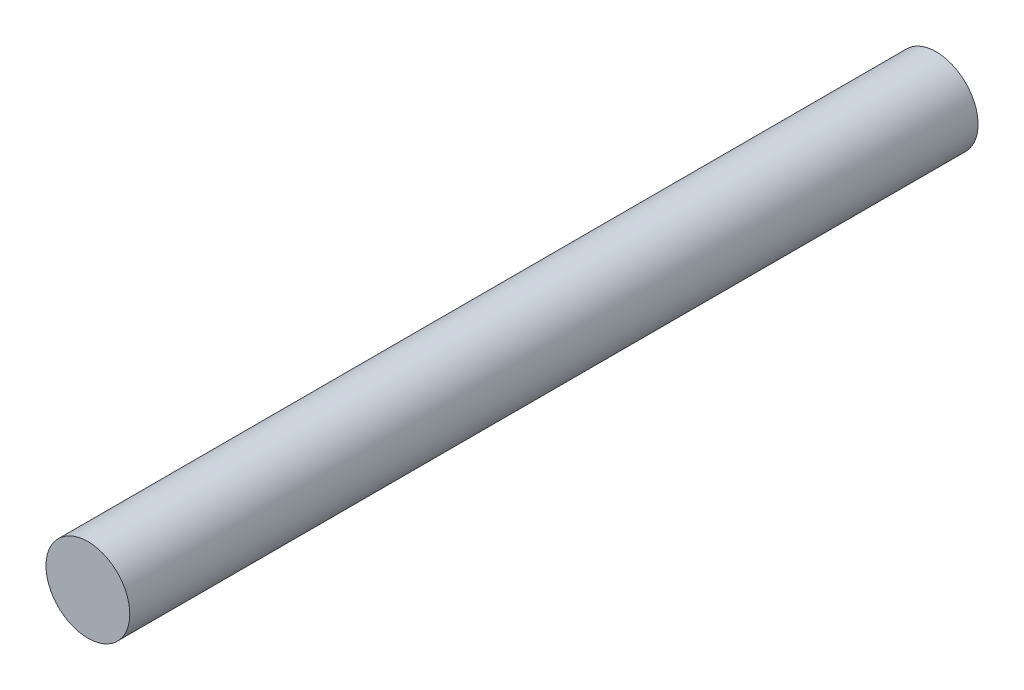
ISO-10303-21;
HEADER;
FILE_DESCRIPTION(('STEP AP214'),'2;1');
FILE_NAME('part.step','',(''),(''),'','','');
FILE_SCHEMA(('AUTOMOTIVE_DESIGN { 1 0 10303 214 1 1 1 1 }'));
ENDSEC;
DATA;
#1=APPLICATION_CONTEXT('core data for automotive mechanical design processes');
#2=APPLICATION_PROTOCOL_DEFINITION('international standard','automotive_design',2000,#1);
#3=PRODUCT_CONTEXT('',#1,'mechanical');
#4=PRODUCT('Part','Part','',(#3));
#5=PRODUCT_RELATED_PRODUCT_CATEGORY('part','',(#4));
#6=PRODUCT_DEFINITION_FORMATION('','',#4);
#7=PRODUCT_DEFINITION_CONTEXT('part definition',#1,'design');
#8=PRODUCT_DEFINITION('design','',#6,#7);
#9=PRODUCT_DEFINITION_SHAPE('','',#8);
#10=(LENGTH_UNIT() NAMED_UNIT(*) SI_UNIT(.MILLI.,.METRE.));
#11=(NAMED_UNIT(*) PLANE_ANGLE_UNIT() SI_UNIT($,.RADIAN.));
#12=(NAMED_UNIT(*) SI_UNIT($,.STERADIAN.) SOLID_ANGLE_UNIT());
#13=UNCERTAINTY_MEASURE_WITH_UNIT(LENGTH_MEASURE(1.E-05),#10,'distance_accuracy_value','');
#14=(GEOMETRIC_REPRESENTATION_CONTEXT(3) GLOBAL_UNCERTAINTY_ASSIGNED_CONTEXT((#13)) GLOBAL_UNIT_ASSIGNED_CONTEXT((#10,
#11,#12)) REPRESENTATION_CONTEXT('',''));
#15=CARTESIAN_POINT('',(0.,0.,0.));
#16=DIRECTION('',(0.,0.,1.));
#17=DIRECTION('',(1.,0.,0.));
#18=AXIS2_PLACEMENT_3D('',#15,#16,#17);
#19=CARTESIAN_POINT('',(-2.024,-2.024,0.));
#20=DIRECTION('',(0.,0.,1.));
#21=DIRECTION('',(1.,0.,0.));
#22=AXIS2_PLACEMENT_3D('',#19,#20,#21);
#23=PLANE('',#22);
#24=CARTESIAN_POINT('',(0.,0.,0.));
#25=DIRECTION('',(0.,0.,-1.));
#26=DIRECTION('',(-1.,0.,0.));
#27=AXIS2_PLACEMENT_3D('',#24,#25,#26);
#28=CIRCLE('',#27,2.);
#29=CARTESIAN_POINT('',(-2.,0.,0.));
#30=VERTEX_POINT('',#29);
#31=EDGE_CURVE('E8',#30,#30,#28,.T.);
#32=ORIENTED_EDGE('',*,*,#31,.T.);
#33=EDGE_LOOP('',(#32));
#34=FACE_BOUND('',#33,.T.);
#35=ADVANCED_FACE('F12',(#34),#23,.F.);
#36=CARTESIAN_POINT('',(0.,0.,39.));
#37=DIRECTION('',(0.,0.,-1.));
#38=DIRECTION('',(-1.,0.,0.));
#39=AXIS2_PLACEMENT_3D('',#36,#37,#38);
#40=CYLINDRICAL_SURFACE('',#39,2.);
#41=ORIENTED_EDGE('',*,*,#31,.F.);
#42=EDGE_LOOP('',(#41));
#43=FACE_BOUND('',#42,.T.);
#44=CARTESIAN_POINT('',(0.,0.,40.5));
#45=DIRECTION('',(0.,0.,1.));
#46=DIRECTION('',(1.,0.,0.));
#47=AXIS2_PLACEMENT_3D('',#44,#45,#46);
#48=CIRCLE('',#47,2.);
#49=CARTESIAN_POINT('',(2.,0.,40.5));
#50=VERTEX_POINT('',#49);
#51=EDGE_CURVE('E18',#50,#50,#48,.T.);
#52=ORIENTED_EDGE('',*,*,#51,.F.);
#53=EDGE_LOOP('',(#52));
#54=FACE_BOUND('',#53,.T.);
#55=ADVANCED_FACE('F26',(#43,#54),#40,.T.);
#56=CARTESIAN_POINT('',(0.,0.,40.5));
#57=DIRECTION('',(0.,0.,1.));
#58=DIRECTION('',(1.,0.,0.));
#59=AXIS2_PLACEMENT_3D('',#56,#57,#58);
#60=PLANE('',#59);
#61=ORIENTED_EDGE('',*,*,#51,.T.);
#62=EDGE_LOOP('',(#61));
#63=FACE_BOUND('',#62,.T.);
#64=ADVANCED_FACE('F24',(#63),#60,.T.);
#65=CLOSED_SHELL('',(#35,#55,#64));
#66=MANIFOLD_SOLID_BREP('B1',#65);
#67=ADVANCED_BREP_SHAPE_REPRESENTATION('',(#18,#66),#14);
#68=SHAPE_DEFINITION_REPRESENTATION(#9,#67);
ENDSEC;
END-ISO-10303-21;
